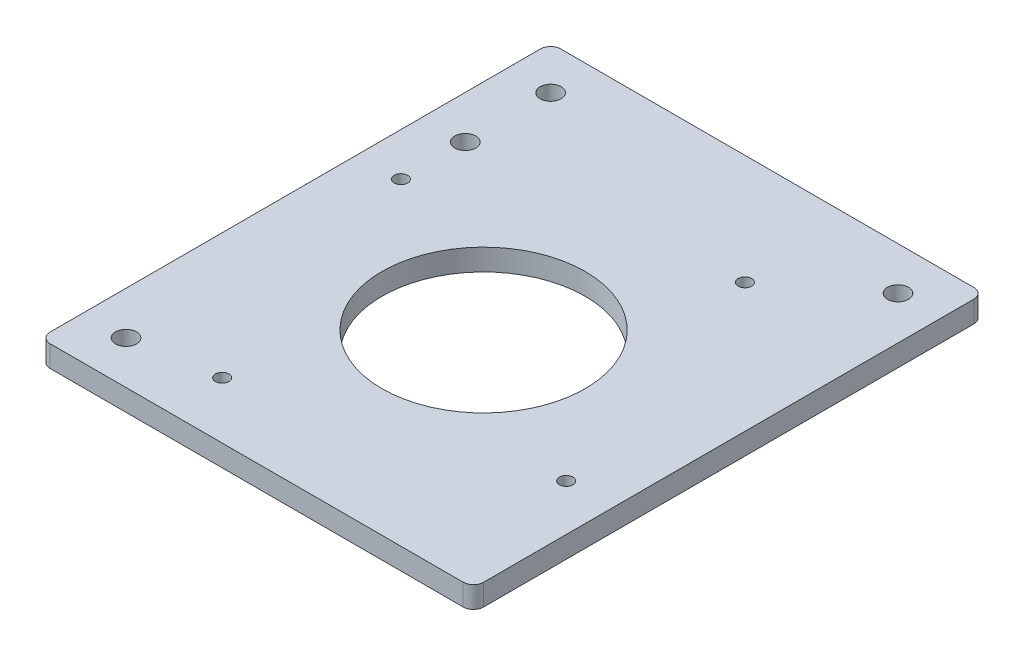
from build123d import *

# Parameters (mm, degrees)
SKETCH1_W           = 128
SKETCH1_H           = 150.8
SKETCH1_R           = 30
SKETCH1_R_2         = 3.1
BOSS_EXTRUDE1_DEPTH = 6.35
FILLET1_R           = 3
SKETCH3_R           = 1.985
CUT_EXTRUDE1_DEPTH  = 637.633938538


with BuildPart() as part:
    # Sketch1 → Boss-Extrude1 (new body)
    with BuildSketch(Plane(origin=(0, 0, 0), x_dir=(1, 0, 0), z_dir=(0, 1, 0))):
        with Locations((77.127334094, -545.362051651)):
            Rectangle(SKETCH1_W, SKETCH1_H)
        with Locations(Location((76.627334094, -553.262051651, 0), (0, 0, 270))):
            Circle(SKETCH1_R, mode=Mode.SUBTRACT)
        with Locations(Location((25.827334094, -482.662051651, 0), (0, 0, 270))):
            Circle(SKETCH1_R_2, mode=Mode.SUBTRACT)
        with Locations(Location((128.427334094, -482.662051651, 0), (0, 0, 270))):
            Circle(SKETCH1_R_2, mode=Mode.SUBTRACT)
        with Locations(Location((25.827334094, -608.062051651, 0), (0, 0, 270))):
            Circle(SKETCH1_R_2, mode=Mode.SUBTRACT)
        with Locations(Location((25.827334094, -507.862051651, 0), (0, 0, 270))):
            Circle(SKETCH1_R_2, mode=Mode.SUBTRACT)
    extrude(amount=BOSS_EXTRUDE1_DEPTH)

    # Fillet1
    fillet1_edges = [part.edges().sort_by_distance(p)[0] for p in [
        (141.127334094, 3.175, 620.762051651),
        (13.127334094, 3.175, 620.762051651),
        (13.127334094, 3.175, 469.962051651),
        (141.127334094, 3.175, 469.962051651),
    ]]
    fillet(fillet1_edges, radius=FILLET1_R)

    # Sketch3 → Cut-Extrude1 (cut, through all)
    with BuildSketch(Plane(origin=(0, 6.35, 0), x_dir=(1, 0, 0), z_dir=(0, 1, 0))):
        with Locations(Location((25.827334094, -526.868476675, 0), (0, 0, 270))):
            Circle(SKETCH3_R)
        with Locations(Location((103.020909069, -502.462051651, 0), (0, 0, 270))):
            Circle(SKETCH3_R)
        with Locations(Location((127.427334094, -579.655626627, 0), (0, 0, 270))):
            Circle(SKETCH3_R)
        with Locations(Location((50.233759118, -604.062051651, 0), (0, 0, 270))):
            Circle(SKETCH3_R)
    extrude(amount=-CUT_EXTRUDE1_DEPTH, mode=Mode.SUBTRACT)


solid = part.part
